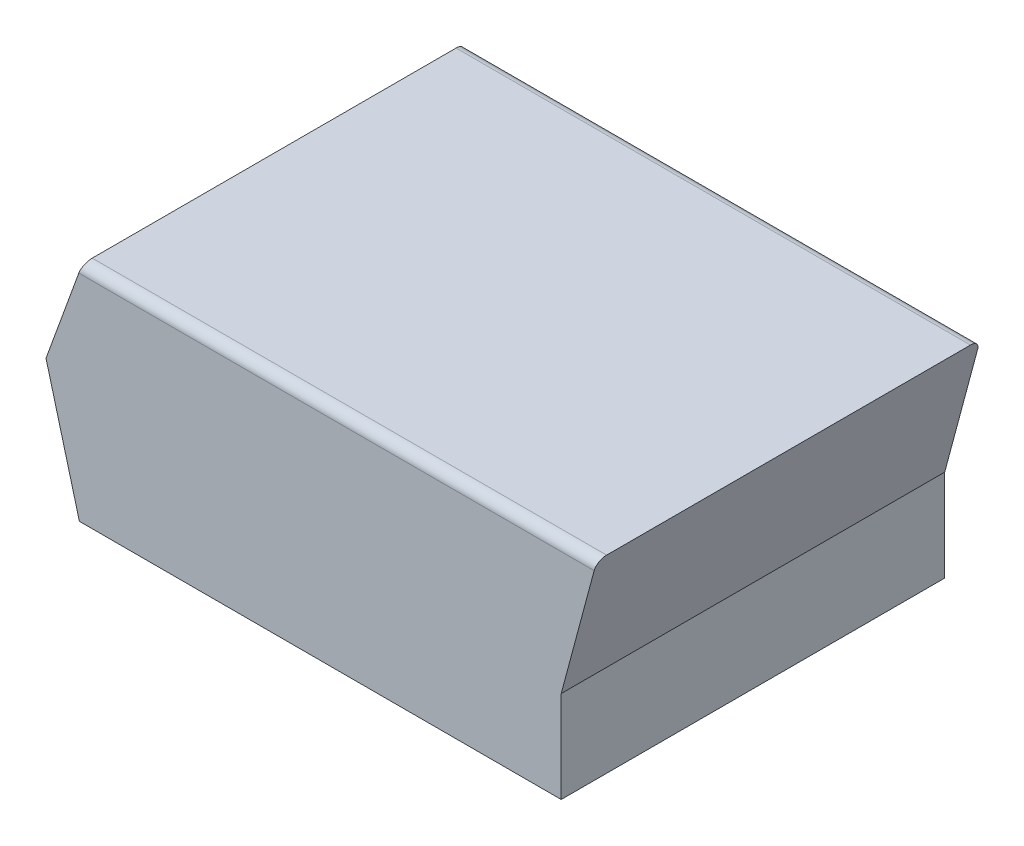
from build123d import *

# Parameters (mm, degrees)
BOSS_EXTRUDE1_DEPTH     = 1170
FILLET1_R               = 30
CUT_EXTRUDE1_DEPTH      = 2081.828817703
CUT_EXTRUDE1_DEPTH_BACK = 50


with BuildPart() as part:
    # Sketch1 → Boss-Extrude1 (new body)
    with BuildSketch(Plane.XY):
        Polygon((0, 0), (1470, 0), (1470, 280), (1578.519422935, 685), (9.190228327, 685), (-101.820693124, 380), align=None)
    extrude(amount=BOSS_EXTRUDE1_DEPTH)

    # Fillet1
    fillet1_edges = [part.edges().sort_by_distance(p)[0] for p in [
        (793.854825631, 685, 1170),
        (793.854825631, 685, 0),
    ]]
    fillet(fillet1_edges, radius=FILLET1_R)

    # Sketch2 → Cut-Extrude1 (cut, two sides: drawn at the far end of the back side and taken through both)
    with BuildSketch(Plane.ZY.offset(-CUT_EXTRUDE1_DEPTH_BACK)):
        with BuildLine():
            Line((385, 155), (385, 0))
            Line((385, 0), (785, 0))
            Line((785, 0), (785, 155))
            ThreePointArc((785, 155), (585, 355), (385, 155))
        make_face()
    extrude(amount=CUT_EXTRUDE1_DEPTH + CUT_EXTRUDE1_DEPTH_BACK, mode=Mode.SUBTRACT)


solid = part.part
